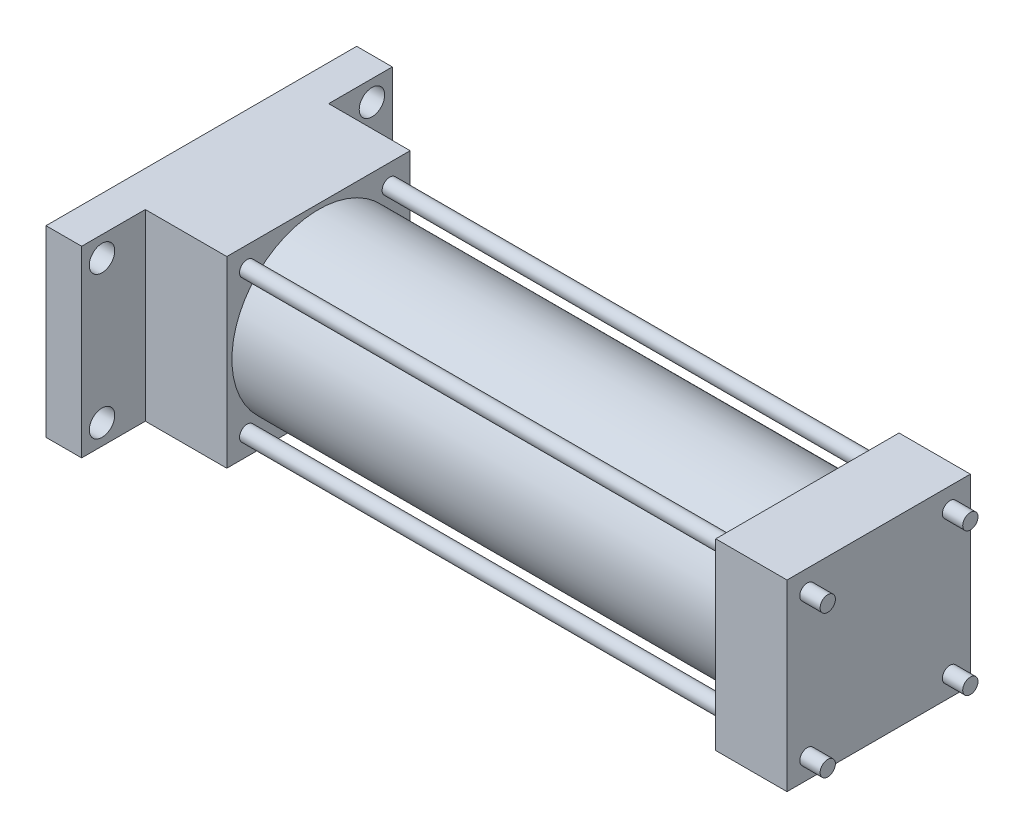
ISO-10303-21;
HEADER;
FILE_DESCRIPTION(('STEP AP214'),'2;1');
FILE_NAME('part.step','',(''),(''),'','','');
FILE_SCHEMA(('AUTOMOTIVE_DESIGN { 1 0 10303 214 1 1 1 1 }'));
ENDSEC;
DATA;
#1=APPLICATION_CONTEXT('core data for automotive mechanical design processes');
#2=APPLICATION_PROTOCOL_DEFINITION('international standard','automotive_design',2000,#1);
#3=PRODUCT_CONTEXT('',#1,'mechanical');
#4=PRODUCT('Part','Part','',(#3));
#5=PRODUCT_RELATED_PRODUCT_CATEGORY('part','',(#4));
#6=PRODUCT_DEFINITION_FORMATION('','',#4);
#7=PRODUCT_DEFINITION_CONTEXT('part definition',#1,'design');
#8=PRODUCT_DEFINITION('design','',#6,#7);
#9=PRODUCT_DEFINITION_SHAPE('','',#8);
#10=(LENGTH_UNIT() NAMED_UNIT(*) SI_UNIT(.MILLI.,.METRE.));
#11=(NAMED_UNIT(*) PLANE_ANGLE_UNIT() SI_UNIT($,.RADIAN.));
#12=(NAMED_UNIT(*) SI_UNIT($,.STERADIAN.) SOLID_ANGLE_UNIT());
#13=UNCERTAINTY_MEASURE_WITH_UNIT(LENGTH_MEASURE(1.E-05),#10,'distance_accuracy_value','');
#14=(GEOMETRIC_REPRESENTATION_CONTEXT(3) GLOBAL_UNCERTAINTY_ASSIGNED_CONTEXT((#13)) GLOBAL_UNIT_ASSIGNED_CONTEXT((#10,
#11,#12)) REPRESENTATION_CONTEXT('',''));
#15=CARTESIAN_POINT('',(0.,0.,0.));
#16=DIRECTION('',(0.,0.,1.));
#17=DIRECTION('',(1.,0.,0.));
#18=AXIS2_PLACEMENT_3D('',#15,#16,#17);
#19=CARTESIAN_POINT('',(-422.275,-57.15,57.1500000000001));
#20=DIRECTION('',(0.,0.,-1.));
#21=DIRECTION('',(0.,1.,0.));
#22=AXIS2_PLACEMENT_3D('',#19,#20,#21);
#23=PLANE('',#22);
#24=DIRECTION('',(0.,1.,0.));
#25=VECTOR('',#24,1.);
#26=CARTESIAN_POINT('',(-400.05,-57.15,57.1500000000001));
#27=LINE('',#26,#25);
#28=CARTESIAN_POINT('',(-400.05,-57.1499999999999,57.15));
#29=VERTEX_POINT('',#28);
#30=CARTESIAN_POINT('',(-400.05,57.15,57.15));
#31=VERTEX_POINT('',#30);
#32=EDGE_CURVE('E177',#29,#31,#27,.T.);
#33=ORIENTED_EDGE('',*,*,#32,.F.);
#34=DIRECTION('',(1.,0.,0.));
#35=VECTOR('',#34,1.);
#36=CARTESIAN_POINT('',(-422.275,-57.15,57.1500000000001));
#37=LINE('',#36,#35);
#38=CARTESIAN_POINT('',(-349.25,-57.15,57.1500000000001));
#39=VERTEX_POINT('',#38);
#40=EDGE_CURVE('E250',#29,#39,#37,.T.);
#41=ORIENTED_EDGE('',*,*,#40,.T.);
#42=DIRECTION('',(0.,1.,0.));
#43=VECTOR('',#42,1.);
#44=CARTESIAN_POINT('',(-349.25,-57.15,57.1500000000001));
#45=LINE('',#44,#43);
#46=CARTESIAN_POINT('',(-349.25,57.15,57.15));
#47=VERTEX_POINT('',#46);
#48=EDGE_CURVE('E235',#39,#47,#45,.T.);
#49=ORIENTED_EDGE('',*,*,#48,.T.);
#50=DIRECTION('',(1.,0.,0.));
#51=VECTOR('',#50,1.);
#52=CARTESIAN_POINT('',(-422.275,57.15,57.15));
#53=LINE('',#52,#51);
#54=EDGE_CURVE('E248',#31,#47,#53,.T.);
#55=ORIENTED_EDGE('',*,*,#54,.F.);
#56=EDGE_LOOP('',(#33,#41,#49,#55));
#57=FACE_BOUND('',#56,.T.);
#58=ADVANCED_FACE('F31',(#57),#23,.F.);
#59=CARTESIAN_POINT('',(-422.275,57.15,-57.15));
#60=DIRECTION('',(0.,0.,1.));
#61=DIRECTION('',(0.,-1.,0.));
#62=AXIS2_PLACEMENT_3D('',#59,#60,#61);
#63=PLANE('',#62);
#64=DIRECTION('',(0.,-1.,0.));
#65=VECTOR('',#64,1.);
#66=CARTESIAN_POINT('',(-400.05,57.15,-57.15));
#67=LINE('',#66,#65);
#68=CARTESIAN_POINT('',(-400.05,57.15,-57.15));
#69=VERTEX_POINT('',#68);
#70=CARTESIAN_POINT('',(-400.05,-57.1499999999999,-57.15));
#71=VERTEX_POINT('',#70);
#72=EDGE_CURVE('E175',#69,#71,#67,.T.);
#73=ORIENTED_EDGE('',*,*,#72,.F.);
#74=DIRECTION('',(1.,0.,0.));
#75=VECTOR('',#74,1.);
#76=CARTESIAN_POINT('',(-422.275,57.15,-57.15));
#77=LINE('',#76,#75);
#78=CARTESIAN_POINT('',(-349.25,57.15,-57.15));
#79=VERTEX_POINT('',#78);
#80=EDGE_CURVE('E246',#69,#79,#77,.T.);
#81=ORIENTED_EDGE('',*,*,#80,.T.);
#82=DIRECTION('',(0.,-1.,0.));
#83=VECTOR('',#82,1.);
#84=CARTESIAN_POINT('',(-349.25,57.15,-57.15));
#85=LINE('',#84,#83);
#86=CARTESIAN_POINT('',(-349.25,-57.15,-57.15));
#87=VERTEX_POINT('',#86);
#88=EDGE_CURVE('E241',#79,#87,#85,.T.);
#89=ORIENTED_EDGE('',*,*,#88,.T.);
#90=DIRECTION('',(1.,0.,0.));
#91=VECTOR('',#90,1.);
#92=CARTESIAN_POINT('',(-422.275,-57.15,-57.15));
#93=LINE('',#92,#91);
#94=EDGE_CURVE('E133',#71,#87,#93,.T.);
#95=ORIENTED_EDGE('',*,*,#94,.F.);
#96=EDGE_LOOP('',(#73,#81,#89,#95));
#97=FACE_BOUND('',#96,.T.);
#98=ADVANCED_FACE('F313',(#97),#63,.F.);
#99=CARTESIAN_POINT('',(-44.45,-57.15,57.1500000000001));
#100=DIRECTION('',(-1.,0.,0.));
#101=DIRECTION('',(0.,0.,1.));
#102=AXIS2_PLACEMENT_3D('',#99,#100,#101);
#103=PLANE('',#102);
#104=CARTESIAN_POINT('',(-44.45,-44.45,44.45));
#105=DIRECTION('',(-1.,0.,0.));
#106=DIRECTION('',(0.,0.,1.));
#107=AXIS2_PLACEMENT_3D('',#104,#105,#106);
#108=CIRCLE('',#107,4.7625);
#109=CARTESIAN_POINT('',(-44.45,-44.45,49.2125));
#110=VERTEX_POINT('',#109);
#111=EDGE_CURVE('E40',#110,#110,#108,.T.);
#112=ORIENTED_EDGE('',*,*,#111,.F.);
#113=EDGE_LOOP('',(#112));
#114=FACE_BOUND('',#113,.T.);
#115=CARTESIAN_POINT('',(-44.45,44.45,44.45));
#116=DIRECTION('',(-1.,0.,0.));
#117=DIRECTION('',(0.,0.,1.));
#118=AXIS2_PLACEMENT_3D('',#115,#116,#117);
#119=CIRCLE('',#118,4.7625);
#120=CARTESIAN_POINT('',(-44.45,44.45,49.2125));
#121=VERTEX_POINT('',#120);
#122=EDGE_CURVE('E216',#121,#121,#119,.F.);
#123=ORIENTED_EDGE('',*,*,#122,.T.);
#124=EDGE_LOOP('',(#123));
#125=FACE_BOUND('',#124,.T.);
#126=DIRECTION('',(0.,-1.,0.));
#127=VECTOR('',#126,1.);
#128=CARTESIAN_POINT('',(-44.45,57.15,57.15));
#129=LINE('',#128,#127);
#130=CARTESIAN_POINT('',(-44.45,57.15,57.15));
#131=VERTEX_POINT('',#130);
#132=CARTESIAN_POINT('',(-44.45,-57.15,57.1500000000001));
#133=VERTEX_POINT('',#132);
#134=EDGE_CURVE('E270',#131,#133,#129,.T.);
#135=ORIENTED_EDGE('',*,*,#134,.F.);
#136=DIRECTION('',(0.,0.,-1.));
#137=VECTOR('',#136,1.);
#138=CARTESIAN_POINT('',(-44.45,57.15,57.15));
#139=LINE('',#138,#137);
#140=CARTESIAN_POINT('',(-44.45,57.15,-57.15));
#141=VERTEX_POINT('',#140);
#142=EDGE_CURVE('E54',#131,#141,#139,.T.);
#143=ORIENTED_EDGE('',*,*,#142,.T.);
#144=DIRECTION('',(0.,1.,0.));
#145=VECTOR('',#144,1.);
#146=CARTESIAN_POINT('',(-44.45,-57.15,-57.15));
#147=LINE('',#146,#145);
#148=CARTESIAN_POINT('',(-44.45,-57.15,-57.15));
#149=VERTEX_POINT('',#148);
#150=EDGE_CURVE('E274',#149,#141,#147,.T.);
#151=ORIENTED_EDGE('',*,*,#150,.F.);
#152=DIRECTION('',(0.,0.,1.));
#153=VECTOR('',#152,1.);
#154=CARTESIAN_POINT('',(-44.45,-57.15,-57.15));
#155=LINE('',#154,#153);
#156=EDGE_CURVE('E272',#149,#133,#155,.T.);
#157=ORIENTED_EDGE('',*,*,#156,.T.);
#158=EDGE_LOOP('',(#135,#143,#151,#157));
#159=FACE_BOUND('',#158,.T.);
#160=CARTESIAN_POINT('',(-44.45,0.,0.));
#161=DIRECTION('',(-1.,0.,0.));
#162=DIRECTION('',(0.,0.,1.));
#163=AXIS2_PLACEMENT_3D('',#160,#161,#162);
#164=CIRCLE('',#163,53.975);
#165=CARTESIAN_POINT('',(-44.45,0.,-53.975));
#166=VERTEX_POINT('',#165);
#167=EDGE_CURVE('E252',#166,#166,#164,.T.);
#168=ORIENTED_EDGE('',*,*,#167,.F.);
#169=EDGE_LOOP('',(#168));
#170=FACE_BOUND('',#169,.T.);
#171=CARTESIAN_POINT('',(-44.45,44.45,-44.45));
#172=DIRECTION('',(-1.,0.,0.));
#173=DIRECTION('',(0.,0.,1.));
#174=AXIS2_PLACEMENT_3D('',#171,#172,#173);
#175=CIRCLE('',#174,4.7625);
#176=CARTESIAN_POINT('',(-44.45,44.45,-39.6875));
#177=VERTEX_POINT('',#176);
#178=EDGE_CURVE('E198',#177,#177,#175,.T.);
#179=ORIENTED_EDGE('',*,*,#178,.F.);
#180=EDGE_LOOP('',(#179));
#181=FACE_BOUND('',#180,.T.);
#182=CARTESIAN_POINT('',(-44.45,-44.45,-44.45));
#183=DIRECTION('',(-1.,0.,0.));
#184=DIRECTION('',(0.,0.,1.));
#185=AXIS2_PLACEMENT_3D('',#182,#183,#184);
#186=CIRCLE('',#185,4.7625);
#187=CARTESIAN_POINT('',(-44.45,-44.45,-39.6875));
#188=VERTEX_POINT('',#187);
#189=EDGE_CURVE('E194',#188,#188,#186,.F.);
#190=ORIENTED_EDGE('',*,*,#189,.T.);
#191=EDGE_LOOP('',(#190));
#192=FACE_BOUND('',#191,.T.);
#193=ADVANCED_FACE('F319',(#114,#125,#159,#170,#181,#192),#103,.T.);
#194=CARTESIAN_POINT('',(0.,-57.15,57.1500000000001));
#195=DIRECTION('',(-1.,0.,0.));
#196=DIRECTION('',(0.,0.,1.));
#197=AXIS2_PLACEMENT_3D('',#194,#195,#196);
#198=PLANE('',#197);
#199=CARTESIAN_POINT('',(0.,-44.45,44.45));
#200=DIRECTION('',(-1.,0.,0.));
#201=DIRECTION('',(0.,0.,1.));
#202=AXIS2_PLACEMENT_3D('',#199,#200,#201);
#203=CIRCLE('',#202,4.7625);
#204=CARTESIAN_POINT('',(0.,-44.45,49.2125));
#205=VERTEX_POINT('',#204);
#206=EDGE_CURVE('E182',#205,#205,#203,.T.);
#207=ORIENTED_EDGE('',*,*,#206,.T.);
#208=EDGE_LOOP('',(#207));
#209=FACE_BOUND('',#208,.T.);
#210=CARTESIAN_POINT('',(0.,44.45,44.45));
#211=DIRECTION('',(-1.,0.,0.));
#212=DIRECTION('',(0.,0.,1.));
#213=AXIS2_PLACEMENT_3D('',#210,#211,#212);
#214=CIRCLE('',#213,4.7625);
#215=CARTESIAN_POINT('',(0.,44.45,49.2125));
#216=VERTEX_POINT('',#215);
#217=EDGE_CURVE('E217',#216,#216,#214,.F.);
#218=ORIENTED_EDGE('',*,*,#217,.F.);
#219=EDGE_LOOP('',(#218));
#220=FACE_BOUND('',#219,.T.);
#221=DIRECTION('',(0.,-1.,0.));
#222=VECTOR('',#221,1.);
#223=CARTESIAN_POINT('',(0.,57.15,57.15));
#224=LINE('',#223,#222);
#225=CARTESIAN_POINT('',(0.,57.15,57.15));
#226=VERTEX_POINT('',#225);
#227=CARTESIAN_POINT('',(0.,-57.15,57.1500000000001));
#228=VERTEX_POINT('',#227);
#229=EDGE_CURVE('E258',#226,#228,#224,.T.);
#230=ORIENTED_EDGE('',*,*,#229,.T.);
#231=DIRECTION('',(0.,0.,1.));
#232=VECTOR('',#231,1.);
#233=CARTESIAN_POINT('',(0.,-57.15,-57.15));
#234=LINE('',#233,#232);
#235=CARTESIAN_POINT('',(0.,-57.15,-57.15));
#236=VERTEX_POINT('',#235);
#237=EDGE_CURVE('E261',#236,#228,#234,.T.);
#238=ORIENTED_EDGE('',*,*,#237,.F.);
#239=DIRECTION('',(0.,1.,0.));
#240=VECTOR('',#239,1.);
#241=CARTESIAN_POINT('',(0.,-57.15,-57.15));
#242=LINE('',#241,#240);
#243=CARTESIAN_POINT('',(0.,57.15,-57.15));
#244=VERTEX_POINT('',#243);
#245=EDGE_CURVE('E264',#236,#244,#242,.T.);
#246=ORIENTED_EDGE('',*,*,#245,.T.);
#247=DIRECTION('',(0.,0.,-1.));
#248=VECTOR('',#247,1.);
#249=CARTESIAN_POINT('',(0.,57.15,57.15));
#250=LINE('',#249,#248);
#251=EDGE_CURVE('E267',#226,#244,#250,.T.);
#252=ORIENTED_EDGE('',*,*,#251,.F.);
#253=EDGE_LOOP('',(#230,#238,#246,#252));
#254=FACE_BOUND('',#253,.T.);
#255=CARTESIAN_POINT('',(0.,44.45,-44.45));
#256=DIRECTION('',(-1.,0.,0.));
#257=DIRECTION('',(0.,0.,1.));
#258=AXIS2_PLACEMENT_3D('',#255,#256,#257);
#259=CIRCLE('',#258,4.7625);
#260=CARTESIAN_POINT('',(0.,44.45,-39.6875));
#261=VERTEX_POINT('',#260);
#262=EDGE_CURVE('E204',#261,#261,#259,.T.);
#263=ORIENTED_EDGE('',*,*,#262,.T.);
#264=EDGE_LOOP('',(#263));
#265=FACE_BOUND('',#264,.T.);
#266=CARTESIAN_POINT('',(0.,-44.45,-44.45));
#267=DIRECTION('',(-1.,0.,0.));
#268=DIRECTION('',(0.,0.,1.));
#269=AXIS2_PLACEMENT_3D('',#266,#267,#268);
#270=CIRCLE('',#269,4.7625);
#271=CARTESIAN_POINT('',(0.,-44.45,-39.6875));
#272=VERTEX_POINT('',#271);
#273=EDGE_CURVE('E195',#272,#272,#270,.F.);
#274=ORIENTED_EDGE('',*,*,#273,.F.);
#275=EDGE_LOOP('',(#274));
#276=FACE_BOUND('',#275,.T.);
#277=ADVANCED_FACE('F334',(#209,#220,#254,#265,#276),#198,.F.);
#278=CARTESIAN_POINT('',(-349.25,-57.15,-57.15));
#279=DIRECTION('',(1.,0.,0.));
#280=DIRECTION('',(0.,0.,-1.));
#281=AXIS2_PLACEMENT_3D('',#278,#279,#280);
#282=PLANE('',#281);
#283=CARTESIAN_POINT('',(-349.25,-44.45,44.45));
#284=DIRECTION('',(1.,0.,0.));
#285=DIRECTION('',(0.,0.,-1.));
#286=AXIS2_PLACEMENT_3D('',#283,#284,#285);
#287=CIRCLE('',#286,4.7625);
#288=CARTESIAN_POINT('',(-349.25,-44.45,39.6875));
#289=VERTEX_POINT('',#288);
#290=EDGE_CURVE('E188',#289,#289,#287,.T.);
#291=ORIENTED_EDGE('',*,*,#290,.F.);
#292=EDGE_LOOP('',(#291));
#293=FACE_BOUND('',#292,.T.);
#294=CARTESIAN_POINT('',(-349.25,44.45,44.45));
#295=DIRECTION('',(1.,0.,0.));
#296=DIRECTION('',(0.,0.,-1.));
#297=AXIS2_PLACEMENT_3D('',#294,#295,#296);
#298=CIRCLE('',#297,4.7625);
#299=CARTESIAN_POINT('',(-349.25,44.45,39.6875));
#300=VERTEX_POINT('',#299);
#301=EDGE_CURVE('E207',#300,#300,#298,.T.);
#302=ORIENTED_EDGE('',*,*,#301,.F.);
#303=EDGE_LOOP('',(#302));
#304=FACE_BOUND('',#303,.T.);
#305=DIRECTION('',(0.,0.,1.));
#306=VECTOR('',#305,1.);
#307=CARTESIAN_POINT('',(-349.25,-57.15,-57.15));
#308=LINE('',#307,#306);
#309=EDGE_CURVE('E232',#87,#39,#308,.T.);
#310=ORIENTED_EDGE('',*,*,#309,.F.);
#311=ORIENTED_EDGE('',*,*,#88,.F.);
#312=DIRECTION('',(0.,0.,-1.));
#313=VECTOR('',#312,1.);
#314=CARTESIAN_POINT('',(-349.25,57.15,57.15));
#315=LINE('',#314,#313);
#316=EDGE_CURVE('E238',#47,#79,#315,.T.);
#317=ORIENTED_EDGE('',*,*,#316,.F.);
#318=ORIENTED_EDGE('',*,*,#48,.F.);
#319=EDGE_LOOP('',(#310,#311,#317,#318));
#320=FACE_BOUND('',#319,.T.);
#321=CARTESIAN_POINT('',(-349.25,0.,0.));
#322=DIRECTION('',(-1.,0.,0.));
#323=DIRECTION('',(0.,0.,1.));
#324=AXIS2_PLACEMENT_3D('',#321,#322,#323);
#325=CIRCLE('',#324,53.975);
#326=CARTESIAN_POINT('',(-349.25,0.,-53.975));
#327=VERTEX_POINT('',#326);
#328=EDGE_CURVE('E255',#327,#327,#325,.T.);
#329=ORIENTED_EDGE('',*,*,#328,.T.);
#330=EDGE_LOOP('',(#329));
#331=FACE_BOUND('',#330,.T.);
#332=CARTESIAN_POINT('',(-349.25,44.45,-44.45));
#333=DIRECTION('',(1.,0.,0.));
#334=DIRECTION('',(0.,0.,-1.));
#335=AXIS2_PLACEMENT_3D('',#332,#333,#334);
#336=CIRCLE('',#335,4.7625);
#337=CARTESIAN_POINT('',(-349.25,44.45,-49.2125));
#338=VERTEX_POINT('',#337);
#339=EDGE_CURVE('E210',#338,#338,#336,.T.);
#340=ORIENTED_EDGE('',*,*,#339,.F.);
#341=EDGE_LOOP('',(#340));
#342=FACE_BOUND('',#341,.T.);
#343=CARTESIAN_POINT('',(-349.25,-44.45,-44.45));
#344=DIRECTION('',(1.,0.,0.));
#345=DIRECTION('',(0.,0.,-1.));
#346=AXIS2_PLACEMENT_3D('',#343,#344,#345);
#347=CIRCLE('',#346,4.7625);
#348=CARTESIAN_POINT('',(-349.25,-44.45,-49.2125));
#349=VERTEX_POINT('',#348);
#350=EDGE_CURVE('E185',#349,#349,#347,.T.);
#351=ORIENTED_EDGE('',*,*,#350,.F.);
#352=EDGE_LOOP('',(#351));
#353=FACE_BOUND('',#352,.T.);
#354=ADVANCED_FACE('F337',(#293,#304,#320,#331,#342,#353),#282,.T.);
#355=CARTESIAN_POINT('',(-422.275,-57.15,-57.15));
#356=DIRECTION('',(1.,0.,0.));
#357=DIRECTION('',(0.,0.,-1.));
#358=AXIS2_PLACEMENT_3D('',#355,#356,#357);
#359=PLANE('',#358);
#360=CARTESIAN_POINT('',(-422.275,44.45,-84.1375));
#361=DIRECTION('',(-1.,0.,0.));
#362=DIRECTION('',(0.,0.,1.));
#363=AXIS2_PLACEMENT_3D('',#360,#361,#362);
#364=CIRCLE('',#363,7.93749999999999);
#365=CARTESIAN_POINT('',(-422.275,44.45,-76.2));
#366=VERTEX_POINT('',#365);
#367=EDGE_CURVE('E647',#366,#366,#364,.T.);
#368=ORIENTED_EDGE('',*,*,#367,.F.);
#369=EDGE_LOOP('',(#368));
#370=FACE_BOUND('',#369,.T.);
#371=CARTESIAN_POINT('',(-422.275,-44.45,-84.1375));
#372=DIRECTION('',(-1.,0.,0.));
#373=DIRECTION('',(0.,0.,1.));
#374=AXIS2_PLACEMENT_3D('',#371,#372,#373);
#375=CIRCLE('',#374,7.93749999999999);
#376=CARTESIAN_POINT('',(-422.275,-44.45,-76.2));
#377=VERTEX_POINT('',#376);
#378=EDGE_CURVE('E651',#377,#377,#375,.T.);
#379=ORIENTED_EDGE('',*,*,#378,.F.);
#380=EDGE_LOOP('',(#379));
#381=FACE_BOUND('',#380,.T.);
#382=CARTESIAN_POINT('',(-422.275,44.45,84.1375));
#383=DIRECTION('',(-1.,0.,0.));
#384=DIRECTION('',(0.,0.,1.));
#385=AXIS2_PLACEMENT_3D('',#382,#383,#384);
#386=CIRCLE('',#385,7.93749999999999);
#387=CARTESIAN_POINT('',(-422.275,44.45,92.075));
#388=VERTEX_POINT('',#387);
#389=EDGE_CURVE('E660',#388,#388,#386,.T.);
#390=ORIENTED_EDGE('',*,*,#389,.F.);
#391=EDGE_LOOP('',(#390));
#392=FACE_BOUND('',#391,.T.);
#393=CARTESIAN_POINT('',(-422.275,-44.45,84.1375));
#394=DIRECTION('',(-1.,0.,0.));
#395=DIRECTION('',(0.,0.,1.));
#396=AXIS2_PLACEMENT_3D('',#393,#394,#395);
#397=CIRCLE('',#396,7.93749999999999);
#398=CARTESIAN_POINT('',(-422.275,-44.45,92.075));
#399=VERTEX_POINT('',#398);
#400=EDGE_CURVE('E155',#399,#399,#397,.T.);
#401=ORIENTED_EDGE('',*,*,#400,.F.);
#402=EDGE_LOOP('',(#401));
#403=FACE_BOUND('',#402,.T.);
#404=DIRECTION('',(0.,0.,1.));
#405=VECTOR('',#404,1.);
#406=CARTESIAN_POINT('',(-422.275,-57.15,-57.15));
#407=LINE('',#406,#405);
#408=CARTESIAN_POINT('',(-422.275,-57.1499999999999,-96.8375));
#409=VERTEX_POINT('',#408);
#410=CARTESIAN_POINT('',(-422.275,-57.1499999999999,96.8375));
#411=VERTEX_POINT('',#410);
#412=EDGE_CURVE('E134',#409,#411,#407,.T.);
#413=ORIENTED_EDGE('',*,*,#412,.T.);
#414=DIRECTION('',(0.,-1.,0.));
#415=VECTOR('',#414,1.);
#416=CARTESIAN_POINT('',(-422.275,57.15,96.8375));
#417=LINE('',#416,#415);
#418=CARTESIAN_POINT('',(-422.275,57.15,96.8375));
#419=VERTEX_POINT('',#418);
#420=EDGE_CURVE('E130',#419,#411,#417,.T.);
#421=ORIENTED_EDGE('',*,*,#420,.F.);
#422=DIRECTION('',(0.,0.,-1.));
#423=VECTOR('',#422,1.);
#424=CARTESIAN_POINT('',(-422.275,57.15,57.15));
#425=LINE('',#424,#423);
#426=CARTESIAN_POINT('',(-422.275,57.15,-96.8375));
#427=VERTEX_POINT('',#426);
#428=EDGE_CURVE('E123',#419,#427,#425,.T.);
#429=ORIENTED_EDGE('',*,*,#428,.T.);
#430=DIRECTION('',(0.,1.,0.));
#431=VECTOR('',#430,1.);
#432=CARTESIAN_POINT('',(-422.275,-57.1499999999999,-96.8375));
#433=LINE('',#432,#431);
#434=EDGE_CURVE('E128',#409,#427,#433,.T.);
#435=ORIENTED_EDGE('',*,*,#434,.F.);
#436=EDGE_LOOP('',(#413,#421,#429,#435));
#437=FACE_BOUND('',#436,.T.);
#438=CARTESIAN_POINT('',(-422.275,0.,0.));
#439=DIRECTION('',(1.,0.,0.));
#440=DIRECTION('',(0.,0.,-1.));
#441=AXIS2_PLACEMENT_3D('',#438,#439,#440);
#442=CIRCLE('',#441,25.4);
#443=CARTESIAN_POINT('',(-422.275,0.,-25.4));
#444=VERTEX_POINT('',#443);
#445=EDGE_CURVE('E220',#444,#444,#442,.F.);
#446=ORIENTED_EDGE('',*,*,#445,.F.);
#447=EDGE_LOOP('',(#446));
#448=FACE_BOUND('',#447,.T.);
#449=ADVANCED_FACE('F125',(#370,#381,#392,#403,#437,#448),#359,.F.);
#450=CARTESIAN_POINT('',(-44.45,57.15,57.15));
#451=DIRECTION('',(0.,0.,1.));
#452=DIRECTION('',(0.,-1.,0.));
#453=AXIS2_PLACEMENT_3D('',#450,#451,#452);
#454=PLANE('',#453);
#455=ORIENTED_EDGE('',*,*,#229,.F.);
#456=DIRECTION('',(1.,0.,0.));
#457=VECTOR('',#456,1.);
#458=CARTESIAN_POINT('',(-44.45,57.15,57.15));
#459=LINE('',#458,#457);
#460=EDGE_CURVE('E47',#131,#226,#459,.T.);
#461=ORIENTED_EDGE('',*,*,#460,.F.);
#462=ORIENTED_EDGE('',*,*,#134,.T.);
#463=DIRECTION('',(1.,0.,0.));
#464=VECTOR('',#463,1.);
#465=CARTESIAN_POINT('',(-44.45,-57.15,57.1500000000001));
#466=LINE('',#465,#464);
#467=EDGE_CURVE('E278',#133,#228,#466,.T.);
#468=ORIENTED_EDGE('',*,*,#467,.T.);
#469=EDGE_LOOP('',(#455,#461,#462,#468));
#470=FACE_BOUND('',#469,.T.);
#471=ADVANCED_FACE('F33',(#470),#454,.T.);
#472=CARTESIAN_POINT('',(-44.45,57.15,57.15));
#473=DIRECTION('',(0.,-1.,0.));
#474=DIRECTION('',(0.,0.,-1.));
#475=AXIS2_PLACEMENT_3D('',#472,#473,#474);
#476=PLANE('',#475);
#477=ORIENTED_EDGE('',*,*,#251,.T.);
#478=DIRECTION('',(1.,0.,0.));
#479=VECTOR('',#478,1.);
#480=CARTESIAN_POINT('',(-44.45,57.15,-57.15));
#481=LINE('',#480,#479);
#482=EDGE_CURVE('E280',#141,#244,#481,.T.);
#483=ORIENTED_EDGE('',*,*,#482,.F.);
#484=ORIENTED_EDGE('',*,*,#142,.F.);
#485=ORIENTED_EDGE('',*,*,#460,.T.);
#486=EDGE_LOOP('',(#477,#483,#484,#485));
#487=FACE_BOUND('',#486,.T.);
#488=ADVANCED_FACE('F342',(#487),#476,.F.);
#489=CARTESIAN_POINT('',(-44.45,-57.15,-57.15));
#490=DIRECTION('',(0.,0.,-1.));
#491=DIRECTION('',(0.,1.,0.));
#492=AXIS2_PLACEMENT_3D('',#489,#490,#491);
#493=PLANE('',#492);
#494=ORIENTED_EDGE('',*,*,#245,.F.);
#495=DIRECTION('',(1.,0.,0.));
#496=VECTOR('',#495,1.);
#497=CARTESIAN_POINT('',(-44.45,-57.15,-57.15));
#498=LINE('',#497,#496);
#499=EDGE_CURVE('E282',#149,#236,#498,.T.);
#500=ORIENTED_EDGE('',*,*,#499,.F.);
#501=ORIENTED_EDGE('',*,*,#150,.T.);
#502=ORIENTED_EDGE('',*,*,#482,.T.);
#503=EDGE_LOOP('',(#494,#500,#501,#502));
#504=FACE_BOUND('',#503,.T.);
#505=ADVANCED_FACE('F345',(#504),#493,.T.);
#506=CARTESIAN_POINT('',(-44.45,-57.15,-57.15));
#507=DIRECTION('',(0.,1.,0.));
#508=DIRECTION('',(0.,0.,1.));
#509=AXIS2_PLACEMENT_3D('',#506,#507,#508);
#510=PLANE('',#509);
#511=ORIENTED_EDGE('',*,*,#237,.T.);
#512=ORIENTED_EDGE('',*,*,#467,.F.);
#513=ORIENTED_EDGE('',*,*,#156,.F.);
#514=ORIENTED_EDGE('',*,*,#499,.T.);
#515=EDGE_LOOP('',(#511,#512,#513,#514));
#516=FACE_BOUND('',#515,.T.);
#517=ADVANCED_FACE('F332',(#516),#510,.F.);
#518=CARTESIAN_POINT('',(-349.25,0.,0.));
#519=DIRECTION('',(1.,0.,0.));
#520=DIRECTION('',(0.,0.,-1.));
#521=AXIS2_PLACEMENT_3D('',#518,#519,#520);
#522=CYLINDRICAL_SURFACE('',#521,53.975);
#523=CARTESIAN_POINT('',(-349.25,0.,-53.975));
#524=CARTESIAN_POINT('',(-346.075,0.,-53.975));
#525=CARTESIAN_POINT('',(-342.9,0.,-53.975));
#526=CARTESIAN_POINT('',(-336.55,0.,-53.975));
#527=CARTESIAN_POINT('',(-333.375,0.,-53.975));
#528=CARTESIAN_POINT('',(-327.025,0.,-53.975));
#529=CARTESIAN_POINT('',(-323.85,0.,-53.975));
#530=CARTESIAN_POINT('',(-317.5,0.,-53.975));
#531=CARTESIAN_POINT('',(-314.325,0.,-53.975));
#532=CARTESIAN_POINT('',(-307.975,0.,-53.975));
#533=CARTESIAN_POINT('',(-304.8,0.,-53.975));
#534=CARTESIAN_POINT('',(-298.45,0.,-53.975));
#535=CARTESIAN_POINT('',(-295.275,0.,-53.975));
#536=CARTESIAN_POINT('',(-288.925,0.,-53.975));
#537=CARTESIAN_POINT('',(-285.75,0.,-53.975));
#538=CARTESIAN_POINT('',(-279.4,0.,-53.975));
#539=CARTESIAN_POINT('',(-276.225,0.,-53.975));
#540=CARTESIAN_POINT('',(-269.875,0.,-53.975));
#541=CARTESIAN_POINT('',(-266.7,0.,-53.975));
#542=CARTESIAN_POINT('',(-260.35,0.,-53.975));
#543=CARTESIAN_POINT('',(-257.175,0.,-53.975));
#544=CARTESIAN_POINT('',(-250.825,0.,-53.975));
#545=CARTESIAN_POINT('',(-247.65,0.,-53.975));
#546=CARTESIAN_POINT('',(-241.3,0.,-53.975));
#547=CARTESIAN_POINT('',(-238.125,0.,-53.975));
#548=CARTESIAN_POINT('',(-231.775,0.,-53.975));
#549=CARTESIAN_POINT('',(-228.6,0.,-53.975));
#550=CARTESIAN_POINT('',(-222.25,0.,-53.975));
#551=CARTESIAN_POINT('',(-219.075,0.,-53.975));
#552=CARTESIAN_POINT('',(-212.725,0.,-53.975));
#553=CARTESIAN_POINT('',(-209.55,0.,-53.975));
#554=CARTESIAN_POINT('',(-203.2,0.,-53.975));
#555=CARTESIAN_POINT('',(-200.025,0.,-53.975));
#556=CARTESIAN_POINT('',(-193.675,0.,-53.975));
#557=CARTESIAN_POINT('',(-190.5,0.,-53.975));
#558=CARTESIAN_POINT('',(-184.15,0.,-53.975));
#559=CARTESIAN_POINT('',(-180.975,0.,-53.975));
#560=CARTESIAN_POINT('',(-174.625,0.,-53.975));
#561=CARTESIAN_POINT('',(-171.45,0.,-53.975));
#562=CARTESIAN_POINT('',(-165.1,0.,-53.975));
#563=CARTESIAN_POINT('',(-161.925,0.,-53.975));
#564=CARTESIAN_POINT('',(-155.575,0.,-53.975));
#565=CARTESIAN_POINT('',(-152.4,0.,-53.975));
#566=CARTESIAN_POINT('',(-146.05,0.,-53.975));
#567=CARTESIAN_POINT('',(-142.875,0.,-53.975));
#568=CARTESIAN_POINT('',(-136.525,0.,-53.975));
#569=CARTESIAN_POINT('',(-133.35,0.,-53.975));
#570=CARTESIAN_POINT('',(-127.,0.,-53.975));
#571=CARTESIAN_POINT('',(-123.825,0.,-53.975));
#572=CARTESIAN_POINT('',(-117.475,0.,-53.975));
#573=CARTESIAN_POINT('',(-114.3,0.,-53.975));
#574=CARTESIAN_POINT('',(-107.95,0.,-53.975));
#575=CARTESIAN_POINT('',(-104.775,0.,-53.975));
#576=CARTESIAN_POINT('',(-98.425,0.,-53.975));
#577=CARTESIAN_POINT('',(-95.25,0.,-53.975));
#578=CARTESIAN_POINT('',(-88.9,0.,-53.975));
#579=CARTESIAN_POINT('',(-85.725,0.,-53.975));
#580=CARTESIAN_POINT('',(-79.375,0.,-53.975));
#581=CARTESIAN_POINT('',(-76.2,0.,-53.975));
#582=CARTESIAN_POINT('',(-69.85,0.,-53.975));
#583=CARTESIAN_POINT('',(-66.675,0.,-53.975));
#584=CARTESIAN_POINT('',(-60.325,0.,-53.975));
#585=CARTESIAN_POINT('',(-57.15,0.,-53.975));
#586=CARTESIAN_POINT('',(-50.8,0.,-53.975));
#587=CARTESIAN_POINT('',(-47.625,0.,-53.975));
#588=CARTESIAN_POINT('',(-44.45,0.,-53.975));
#589=B_SPLINE_CURVE_WITH_KNOTS('',3,(#523,#524,#525,#526,#527,#528,#529,#530,#531,#532,#533,
#534,#535,#536,#537,#538,#539,#540,#541,#542,#543,#544,#545,#546,#547,#548,#549,#550,#551,#552,
#553,#554,#555,#556,#557,#558,#559,#560,#561,#562,#563,#564,#565,#566,#567,#568,#569,#570,#571,
#572,#573,#574,#575,#576,#577,#578,#579,#580,#581,#582,#583,#584,#585,#586,#587,#588),
.UNSPECIFIED.,.F.,.F.,(4,2,2,2,2,2,2,2,2,2,2,2,2,2,2,2,2,2,2,2,2,2,2,2,2,2,2,2,2,2,2,2,4),(0.,
9.52500000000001,19.05,28.575,38.1,47.625,57.15,66.675,76.2,85.7250000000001,95.2500000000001,
104.775,114.3,123.825,133.35,142.875,152.4,161.925,171.45,180.975,190.5,200.025,209.55,219.075,
228.6,238.125,247.65,257.175,266.7,276.225,285.75,295.275,304.8),.UNSPECIFIED.);
#590=EDGE_CURVE('BSEAM328',#327,#166,#589,.T.);
#591=ORIENTED_EDGE('',*,*,#328,.F.);
#592=ORIENTED_EDGE('',*,*,#167,.T.);
#593=ORIENTED_EDGE('',*,*,#590,.T.);
#594=ORIENTED_EDGE('',*,*,#590,.F.);
#595=EDGE_LOOP('',(#591,#593,#592,#594));
#596=FACE_BOUND('',#595,.T.);
#597=ADVANCED_FACE('F328',(#596),#522,.T.);
#598=CARTESIAN_POINT('',(-422.275,-57.15,-57.15));
#599=DIRECTION('',(0.,1.,0.));
#600=DIRECTION('',(0.,0.,1.));
#601=AXIS2_PLACEMENT_3D('',#598,#599,#600);
#602=PLANE('',#601);
#603=ORIENTED_EDGE('',*,*,#412,.F.);
#604=DIRECTION('',(-1.,0.,0.));
#605=VECTOR('',#604,1.);
#606=CARTESIAN_POINT('',(-400.05,-57.1499999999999,-96.8375));
#607=LINE('',#606,#605);
#608=CARTESIAN_POINT('',(-400.05,-57.1499999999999,-96.8375));
#609=VERTEX_POINT('',#608);
#610=EDGE_CURVE('E149',#609,#409,#607,.T.);
#611=ORIENTED_EDGE('',*,*,#610,.F.);
#612=DIRECTION('',(0.,0.,1.));
#613=VECTOR('',#612,1.);
#614=CARTESIAN_POINT('',(-400.05,-57.1499999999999,-96.8375));
#615=LINE('',#614,#613);
#616=EDGE_CURVE('E167',#609,#71,#615,.T.);
#617=ORIENTED_EDGE('',*,*,#616,.T.);
#618=ORIENTED_EDGE('',*,*,#94,.T.);
#619=ORIENTED_EDGE('',*,*,#309,.T.);
#620=ORIENTED_EDGE('',*,*,#40,.F.);
#621=CARTESIAN_POINT('',(-400.05,-57.1499999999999,96.8375));
#622=VERTEX_POINT('',#621);
#623=EDGE_CURVE('E166',#29,#622,#615,.T.);
#624=ORIENTED_EDGE('',*,*,#623,.T.);
#625=DIRECTION('',(-1.,0.,0.));
#626=VECTOR('',#625,1.);
#627=CARTESIAN_POINT('',(-400.05,-57.1499999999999,96.8375));
#628=LINE('',#627,#626);
#629=EDGE_CURVE('E171',#622,#411,#628,.T.);
#630=ORIENTED_EDGE('',*,*,#629,.T.);
#631=EDGE_LOOP('',(#603,#611,#617,#618,#619,#620,#624,#630));
#632=FACE_BOUND('',#631,.T.);
#633=ADVANCED_FACE('F325',(#632),#602,.F.);
#634=CARTESIAN_POINT('',(-422.275,57.15,57.15));
#635=DIRECTION('',(0.,-1.,0.));
#636=DIRECTION('',(0.,0.,-1.));
#637=AXIS2_PLACEMENT_3D('',#634,#635,#636);
#638=PLANE('',#637);
#639=ORIENTED_EDGE('',*,*,#428,.F.);
#640=DIRECTION('',(-1.,0.,0.));
#641=VECTOR('',#640,1.);
#642=CARTESIAN_POINT('',(-400.05,57.15,96.8375));
#643=LINE('',#642,#641);
#644=CARTESIAN_POINT('',(-400.05,57.15,96.8375));
#645=VERTEX_POINT('',#644);
#646=EDGE_CURVE('E145',#645,#419,#643,.T.);
#647=ORIENTED_EDGE('',*,*,#646,.F.);
#648=DIRECTION('',(0.,0.,-1.));
#649=VECTOR('',#648,1.);
#650=CARTESIAN_POINT('',(-400.05,57.15,96.8375));
#651=LINE('',#650,#649);
#652=EDGE_CURVE('E160',#645,#31,#651,.T.);
#653=ORIENTED_EDGE('',*,*,#652,.T.);
#654=ORIENTED_EDGE('',*,*,#54,.T.);
#655=ORIENTED_EDGE('',*,*,#316,.T.);
#656=ORIENTED_EDGE('',*,*,#80,.F.);
#657=CARTESIAN_POINT('',(-400.05,57.15,-96.8375));
#658=VERTEX_POINT('',#657);
#659=EDGE_CURVE('E140',#69,#658,#651,.T.);
#660=ORIENTED_EDGE('',*,*,#659,.T.);
#661=DIRECTION('',(-1.,0.,0.));
#662=VECTOR('',#661,1.);
#663=CARTESIAN_POINT('',(-400.05,57.15,-96.8375));
#664=LINE('',#663,#662);
#665=EDGE_CURVE('E137',#658,#427,#664,.T.);
#666=ORIENTED_EDGE('',*,*,#665,.T.);
#667=EDGE_LOOP('',(#639,#647,#653,#654,#655,#656,#660,#666));
#668=FACE_BOUND('',#667,.T.);
#669=ADVANCED_FACE('F138',(#668),#638,.F.);
#670=CARTESIAN_POINT('',(-447.675,0.,0.));
#671=DIRECTION('',(1.,0.,0.));
#672=DIRECTION('',(0.,0.,-1.));
#673=AXIS2_PLACEMENT_3D('',#670,#671,#672);
#674=CYLINDRICAL_SURFACE('',#673,25.4);
#675=CARTESIAN_POINT('',(-447.675,0.,0.));
#676=DIRECTION('',(-1.,0.,0.));
#677=DIRECTION('',(0.,0.,1.));
#678=AXIS2_PLACEMENT_3D('',#675,#676,#677);
#679=CIRCLE('',#678,25.4);
#680=CARTESIAN_POINT('',(-447.675,0.,25.4));
#681=VERTEX_POINT('',#680);
#682=EDGE_CURVE('E229',#681,#681,#679,.T.);
#683=ORIENTED_EDGE('',*,*,#682,.F.);
#684=EDGE_LOOP('',(#683));
#685=FACE_BOUND('',#684,.T.);
#686=ORIENTED_EDGE('',*,*,#445,.T.);
#687=EDGE_LOOP('',(#686));
#688=FACE_BOUND('',#687,.T.);
#689=ADVANCED_FACE('F387',(#685,#688),#674,.T.);
#690=CARTESIAN_POINT('',(-447.675,0.,0.));
#691=DIRECTION('',(-1.,0.,0.));
#692=DIRECTION('',(0.,0.,1.));
#693=AXIS2_PLACEMENT_3D('',#690,#691,#692);
#694=PLANE('',#693);
#695=CARTESIAN_POINT('',(-447.675,0.,0.));
#696=DIRECTION('',(-1.,0.,0.));
#697=DIRECTION('',(0.,0.,1.));
#698=AXIS2_PLACEMENT_3D('',#695,#696,#697);
#699=CIRCLE('',#698,17.4625);
#700=CARTESIAN_POINT('',(-447.675,0.,17.4625));
#701=VERTEX_POINT('',#700);
#702=EDGE_CURVE('E223',#701,#701,#699,.T.);
#703=ORIENTED_EDGE('',*,*,#702,.F.);
#704=EDGE_LOOP('',(#703));
#705=FACE_BOUND('',#704,.T.);
#706=ORIENTED_EDGE('',*,*,#682,.T.);
#707=EDGE_LOOP('',(#706));
#708=FACE_BOUND('',#707,.T.);
#709=ADVANCED_FACE('F390',(#705,#708),#694,.T.);
#710=CARTESIAN_POINT('',(4.94140866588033,0.,0.));
#711=DIRECTION('',(-1.,0.,0.));
#712=DIRECTION('',(0.,0.,1.));
#713=AXIS2_PLACEMENT_3D('',#710,#711,#712);
#714=CYLINDRICAL_SURFACE('',#713,17.4625);
#715=CARTESIAN_POINT('',(-422.275,0.,0.));
#716=DIRECTION('',(-1.,0.,0.));
#717=DIRECTION('',(0.,0.,1.));
#718=AXIS2_PLACEMENT_3D('',#715,#716,#717);
#719=CIRCLE('',#718,17.4625);
#720=CARTESIAN_POINT('',(-422.275,0.,17.4625));
#721=VERTEX_POINT('',#720);
#722=EDGE_CURVE('E144',#721,#721,#719,.F.);
#723=ORIENTED_EDGE('',*,*,#722,.T.);
#724=EDGE_LOOP('',(#723));
#725=FACE_BOUND('',#724,.T.);
#726=ORIENTED_EDGE('',*,*,#702,.T.);
#727=EDGE_LOOP('',(#726));
#728=FACE_BOUND('',#727,.T.);
#729=ADVANCED_FACE('F293',(#725,#728),#714,.F.);
#730=CARTESIAN_POINT('',(26.1703841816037,44.45,44.45));
#731=DIRECTION('',(-1.,0.,0.));
#732=DIRECTION('',(0.,0.,1.));
#733=AXIS2_PLACEMENT_3D('',#730,#731,#732);
#734=CYLINDRICAL_SURFACE('',#733,4.7625);
#735=ORIENTED_EDGE('',*,*,#122,.F.);
#736=EDGE_LOOP('',(#735));
#737=FACE_BOUND('',#736,.T.);
#738=ORIENTED_EDGE('',*,*,#301,.T.);
#739=EDGE_LOOP('',(#738));
#740=FACE_BOUND('',#739,.T.);
#741=ADVANCED_FACE('F396',(#737,#740),#734,.T.);
#742=CARTESIAN_POINT('',(12.7,44.45,44.45));
#743=DIRECTION('',(1.,0.,0.));
#744=DIRECTION('',(0.,0.,-1.));
#745=AXIS2_PLACEMENT_3D('',#742,#743,#744);
#746=CIRCLE('',#745,4.7625);
#747=CARTESIAN_POINT('',(12.7,44.45,39.6875));
#748=VERTEX_POINT('',#747);
#749=EDGE_CURVE('E213',#748,#748,#746,.T.);
#750=ORIENTED_EDGE('',*,*,#749,.F.);
#751=EDGE_LOOP('',(#750));
#752=FACE_BOUND('',#751,.T.);
#753=ORIENTED_EDGE('',*,*,#217,.T.);
#754=EDGE_LOOP('',(#753));
#755=FACE_BOUND('',#754,.T.);
#756=ADVANCED_FACE('F408',(#752,#755),#734,.T.);
#757=CARTESIAN_POINT('',(12.7,-57.15,57.1500000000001));
#758=DIRECTION('',(1.,0.,0.));
#759=DIRECTION('',(0.,0.,-1.));
#760=AXIS2_PLACEMENT_3D('',#757,#758,#759);
#761=PLANE('',#760);
#762=ORIENTED_EDGE('',*,*,#749,.T.);
#763=EDGE_LOOP('',(#762));
#764=FACE_BOUND('',#763,.T.);
#765=ADVANCED_FACE('F404',(#764),#761,.T.);
#766=CARTESIAN_POINT('',(26.1703841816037,44.45,-44.45));
#767=DIRECTION('',(-1.,0.,0.));
#768=DIRECTION('',(0.,0.,1.));
#769=AXIS2_PLACEMENT_3D('',#766,#767,#768);
#770=CYLINDRICAL_SURFACE('',#769,4.7625);
#771=ORIENTED_EDGE('',*,*,#178,.T.);
#772=EDGE_LOOP('',(#771));
#773=FACE_BOUND('',#772,.T.);
#774=ORIENTED_EDGE('',*,*,#339,.T.);
#775=EDGE_LOOP('',(#774));
#776=FACE_BOUND('',#775,.T.);
#777=ADVANCED_FACE('F407',(#773,#776),#770,.T.);
#778=CARTESIAN_POINT('',(12.7,44.45,-44.45));
#779=DIRECTION('',(1.,0.,0.));
#780=DIRECTION('',(0.,0.,-1.));
#781=AXIS2_PLACEMENT_3D('',#778,#779,#780);
#782=CIRCLE('',#781,4.7625);
#783=CARTESIAN_POINT('',(12.7,44.45,-49.2125));
#784=VERTEX_POINT('',#783);
#785=EDGE_CURVE('E201',#784,#784,#782,.F.);
#786=ORIENTED_EDGE('',*,*,#785,.T.);
#787=EDGE_LOOP('',(#786));
#788=FACE_BOUND('',#787,.T.);
#789=ORIENTED_EDGE('',*,*,#262,.F.);
#790=EDGE_LOOP('',(#789));
#791=FACE_BOUND('',#790,.T.);
#792=ADVANCED_FACE('F414',(#788,#791),#770,.T.);
#793=CARTESIAN_POINT('',(12.7,-57.15,57.1500000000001));
#794=DIRECTION('',(1.,0.,0.));
#795=DIRECTION('',(0.,0.,-1.));
#796=AXIS2_PLACEMENT_3D('',#793,#794,#795);
#797=PLANE('',#796);
#798=ORIENTED_EDGE('',*,*,#785,.F.);
#799=EDGE_LOOP('',(#798));
#800=FACE_BOUND('',#799,.T.);
#801=ADVANCED_FACE('F371',(#800),#797,.T.);
#802=CARTESIAN_POINT('',(26.1703841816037,-44.45,-44.45));
#803=DIRECTION('',(-1.,0.,0.));
#804=DIRECTION('',(0.,0.,1.));
#805=AXIS2_PLACEMENT_3D('',#802,#803,#804);
#806=CYLINDRICAL_SURFACE('',#805,4.7625);
#807=ORIENTED_EDGE('',*,*,#189,.F.);
#808=EDGE_LOOP('',(#807));
#809=FACE_BOUND('',#808,.T.);
#810=ORIENTED_EDGE('',*,*,#350,.T.);
#811=EDGE_LOOP('',(#810));
#812=FACE_BOUND('',#811,.T.);
#813=ADVANCED_FACE('F367',(#809,#812),#806,.T.);
#814=CARTESIAN_POINT('',(12.7,-44.45,-44.45));
#815=DIRECTION('',(1.,0.,0.));
#816=DIRECTION('',(0.,0.,-1.));
#817=AXIS2_PLACEMENT_3D('',#814,#815,#816);
#818=CIRCLE('',#817,4.7625);
#819=CARTESIAN_POINT('',(12.7,-44.45,-49.2125));
#820=VERTEX_POINT('',#819);
#821=EDGE_CURVE('E191',#820,#820,#818,.T.);
#822=ORIENTED_EDGE('',*,*,#821,.F.);
#823=EDGE_LOOP('',(#822));
#824=FACE_BOUND('',#823,.T.);
#825=ORIENTED_EDGE('',*,*,#273,.T.);
#826=EDGE_LOOP('',(#825));
#827=FACE_BOUND('',#826,.T.);
#828=ADVANCED_FACE('F370',(#824,#827),#806,.T.);
#829=CARTESIAN_POINT('',(12.7,-57.15,57.1500000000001));
#830=DIRECTION('',(1.,0.,0.));
#831=DIRECTION('',(0.,0.,-1.));
#832=AXIS2_PLACEMENT_3D('',#829,#830,#831);
#833=PLANE('',#832);
#834=ORIENTED_EDGE('',*,*,#821,.T.);
#835=EDGE_LOOP('',(#834));
#836=FACE_BOUND('',#835,.T.);
#837=ADVANCED_FACE('F419',(#836),#833,.T.);
#838=CARTESIAN_POINT('',(26.1703841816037,-44.45,44.45));
#839=DIRECTION('',(-1.,0.,0.));
#840=DIRECTION('',(0.,0.,1.));
#841=AXIS2_PLACEMENT_3D('',#838,#839,#840);
#842=CYLINDRICAL_SURFACE('',#841,4.7625);
#843=ORIENTED_EDGE('',*,*,#111,.T.);
#844=EDGE_LOOP('',(#843));
#845=FACE_BOUND('',#844,.T.);
#846=ORIENTED_EDGE('',*,*,#290,.T.);
#847=EDGE_LOOP('',(#846));
#848=FACE_BOUND('',#847,.T.);
#849=ADVANCED_FACE('F421',(#845,#848),#842,.T.);
#850=CARTESIAN_POINT('',(12.7,-44.45,44.45));
#851=DIRECTION('',(1.,0.,0.));
#852=DIRECTION('',(0.,0.,-1.));
#853=AXIS2_PLACEMENT_3D('',#850,#851,#852);
#854=CIRCLE('',#853,4.7625);
#855=CARTESIAN_POINT('',(12.7,-44.45,39.6875));
#856=VERTEX_POINT('',#855);
#857=EDGE_CURVE('E179',#856,#856,#854,.F.);
#858=ORIENTED_EDGE('',*,*,#857,.T.);
#859=EDGE_LOOP('',(#858));
#860=FACE_BOUND('',#859,.T.);
#861=ORIENTED_EDGE('',*,*,#206,.F.);
#862=EDGE_LOOP('',(#861));
#863=FACE_BOUND('',#862,.T.);
#864=ADVANCED_FACE('F307',(#860,#863),#842,.T.);
#865=CARTESIAN_POINT('',(12.7,-57.15,57.1500000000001));
#866=DIRECTION('',(1.,0.,0.));
#867=DIRECTION('',(0.,0.,-1.));
#868=AXIS2_PLACEMENT_3D('',#865,#866,#867);
#869=PLANE('',#868);
#870=ORIENTED_EDGE('',*,*,#857,.F.);
#871=EDGE_LOOP('',(#870));
#872=FACE_BOUND('',#871,.T.);
#873=ADVANCED_FACE('F298',(#872),#869,.T.);
#874=CARTESIAN_POINT('',(-422.275,57.15,-96.8375));
#875=DIRECTION('',(-1.,0.,0.));
#876=DIRECTION('',(0.,0.,1.));
#877=AXIS2_PLACEMENT_3D('',#874,#875,#876);
#878=PLANE('',#877);
#879=ORIENTED_EDGE('',*,*,#722,.F.);
#880=EDGE_LOOP('',(#879));
#881=FACE_BOUND('',#880,.T.);
#882=ADVANCED_FACE('F296',(#881),#878,.T.);
#883=CARTESIAN_POINT('',(-400.05,-57.1499999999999,-96.8375));
#884=DIRECTION('',(0.,0.,1.));
#885=DIRECTION('',(1.,0.,0.));
#886=AXIS2_PLACEMENT_3D('',#883,#884,#885);
#887=PLANE('',#886);
#888=ORIENTED_EDGE('',*,*,#434,.T.);
#889=ORIENTED_EDGE('',*,*,#665,.F.);
#890=DIRECTION('',(0.,1.,0.));
#891=VECTOR('',#890,1.);
#892=CARTESIAN_POINT('',(-400.05,-57.1499999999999,-96.8375));
#893=LINE('',#892,#891);
#894=EDGE_CURVE('E152',#609,#658,#893,.T.);
#895=ORIENTED_EDGE('',*,*,#894,.F.);
#896=ORIENTED_EDGE('',*,*,#610,.T.);
#897=EDGE_LOOP('',(#888,#889,#895,#896));
#898=FACE_BOUND('',#897,.T.);
#899=ADVANCED_FACE('F148',(#898),#887,.F.);
#900=CARTESIAN_POINT('',(-400.05,57.15,-96.8375));
#901=DIRECTION('',(-1.,0.,0.));
#902=DIRECTION('',(0.,0.,1.));
#903=AXIS2_PLACEMENT_3D('',#900,#901,#902);
#904=PLANE('',#903);
#905=CARTESIAN_POINT('',(-400.05,44.45,-84.1375));
#906=DIRECTION('',(-1.,0.,0.));
#907=DIRECTION('',(0.,0.,1.));
#908=AXIS2_PLACEMENT_3D('',#905,#906,#907);
#909=CIRCLE('',#908,7.93749999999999);
#910=CARTESIAN_POINT('',(-400.05,44.45,-76.2));
#911=VERTEX_POINT('',#910);
#912=EDGE_CURVE('E650',#911,#911,#909,.F.);
#913=ORIENTED_EDGE('',*,*,#912,.F.);
#914=EDGE_LOOP('',(#913));
#915=FACE_BOUND('',#914,.T.);
#916=CARTESIAN_POINT('',(-400.05,-44.45,-84.1375));
#917=DIRECTION('',(-1.,0.,0.));
#918=DIRECTION('',(0.,0.,1.));
#919=AXIS2_PLACEMENT_3D('',#916,#917,#918);
#920=CIRCLE('',#919,7.93749999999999);
#921=CARTESIAN_POINT('',(-400.05,-44.45,-76.2));
#922=VERTEX_POINT('',#921);
#923=EDGE_CURVE('E654',#922,#922,#920,.F.);
#924=ORIENTED_EDGE('',*,*,#923,.F.);
#925=EDGE_LOOP('',(#924));
#926=FACE_BOUND('',#925,.T.);
#927=ORIENTED_EDGE('',*,*,#659,.F.);
#928=ORIENTED_EDGE('',*,*,#72,.T.);
#929=ORIENTED_EDGE('',*,*,#616,.F.);
#930=ORIENTED_EDGE('',*,*,#894,.T.);
#931=EDGE_LOOP('',(#927,#928,#929,#930));
#932=FACE_BOUND('',#931,.T.);
#933=ADVANCED_FACE('F304',(#915,#926,#932),#904,.F.);
#934=CARTESIAN_POINT('',(-400.05,44.45,84.1375));
#935=DIRECTION('',(-1.,0.,0.));
#936=DIRECTION('',(0.,0.,1.));
#937=AXIS2_PLACEMENT_3D('',#934,#935,#936);
#938=CIRCLE('',#937,7.93749999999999);
#939=CARTESIAN_POINT('',(-400.05,44.45,92.075));
#940=VERTEX_POINT('',#939);
#941=EDGE_CURVE('E663',#940,#940,#938,.F.);
#942=ORIENTED_EDGE('',*,*,#941,.F.);
#943=EDGE_LOOP('',(#942));
#944=FACE_BOUND('',#943,.T.);
#945=CARTESIAN_POINT('',(-400.05,-44.45,84.1375));
#946=DIRECTION('',(-1.,0.,0.));
#947=DIRECTION('',(0.,0.,1.));
#948=AXIS2_PLACEMENT_3D('',#945,#946,#947);
#949=CIRCLE('',#948,7.93749999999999);
#950=CARTESIAN_POINT('',(-400.05,-44.45,92.075));
#951=VERTEX_POINT('',#950);
#952=EDGE_CURVE('E150',#951,#951,#949,.F.);
#953=ORIENTED_EDGE('',*,*,#952,.F.);
#954=EDGE_LOOP('',(#953));
#955=FACE_BOUND('',#954,.T.);
#956=ORIENTED_EDGE('',*,*,#623,.F.);
#957=ORIENTED_EDGE('',*,*,#32,.T.);
#958=ORIENTED_EDGE('',*,*,#652,.F.);
#959=DIRECTION('',(0.,-1.,0.));
#960=VECTOR('',#959,1.);
#961=CARTESIAN_POINT('',(-400.05,57.15,96.8375));
#962=LINE('',#961,#960);
#963=EDGE_CURVE('E163',#645,#622,#962,.T.);
#964=ORIENTED_EDGE('',*,*,#963,.T.);
#965=EDGE_LOOP('',(#956,#957,#958,#964));
#966=FACE_BOUND('',#965,.T.);
#967=ADVANCED_FACE('F430',(#944,#955,#966),#904,.F.);
#968=CARTESIAN_POINT('',(-400.05,57.15,96.8375));
#969=DIRECTION('',(0.,0.,-1.));
#970=DIRECTION('',(-1.,0.,0.));
#971=AXIS2_PLACEMENT_3D('',#968,#969,#970);
#972=PLANE('',#971);
#973=ORIENTED_EDGE('',*,*,#420,.T.);
#974=ORIENTED_EDGE('',*,*,#629,.F.);
#975=ORIENTED_EDGE('',*,*,#963,.F.);
#976=ORIENTED_EDGE('',*,*,#646,.T.);
#977=EDGE_LOOP('',(#973,#974,#975,#976));
#978=FACE_BOUND('',#977,.T.);
#979=ADVANCED_FACE('F427',(#978),#972,.F.);
#980=CARTESIAN_POINT('',(12.701,-44.45,84.1375));
#981=DIRECTION('',(-1.,0.,0.));
#982=DIRECTION('',(0.,0.,1.));
#983=AXIS2_PLACEMENT_3D('',#980,#981,#982);
#984=CYLINDRICAL_SURFACE('',#983,7.93749999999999);
#985=ORIENTED_EDGE('',*,*,#400,.T.);
#986=EDGE_LOOP('',(#985));
#987=FACE_BOUND('',#986,.T.);
#988=ORIENTED_EDGE('',*,*,#952,.T.);
#989=EDGE_LOOP('',(#988));
#990=FACE_BOUND('',#989,.T.);
#991=ADVANCED_FACE('F429',(#987,#990),#984,.F.);
#992=CARTESIAN_POINT('',(12.701,44.45,84.1375));
#993=DIRECTION('',(-1.,0.,0.));
#994=DIRECTION('',(0.,0.,1.));
#995=AXIS2_PLACEMENT_3D('',#992,#993,#994);
#996=CYLINDRICAL_SURFACE('',#995,7.93749999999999);
#997=ORIENTED_EDGE('',*,*,#389,.T.);
#998=EDGE_LOOP('',(#997));
#999=FACE_BOUND('',#998,.T.);
#1000=ORIENTED_EDGE('',*,*,#941,.T.);
#1001=EDGE_LOOP('',(#1000));
#1002=FACE_BOUND('',#1001,.T.);
#1003=ADVANCED_FACE('F459',(#999,#1002),#996,.F.);
#1004=CARTESIAN_POINT('',(12.701,-44.45,-84.1375));
#1005=DIRECTION('',(-1.,0.,0.));
#1006=DIRECTION('',(0.,0.,1.));
#1007=AXIS2_PLACEMENT_3D('',#1004,#1005,#1006);
#1008=CYLINDRICAL_SURFACE('',#1007,7.93749999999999);
#1009=ORIENTED_EDGE('',*,*,#378,.T.);
#1010=EDGE_LOOP('',(#1009));
#1011=FACE_BOUND('',#1010,.T.);
#1012=ORIENTED_EDGE('',*,*,#923,.T.);
#1013=EDGE_LOOP('',(#1012));
#1014=FACE_BOUND('',#1013,.T.);
#1015=ADVANCED_FACE('F626',(#1011,#1014),#1008,.F.);
#1016=CARTESIAN_POINT('',(12.701,44.45,-84.1375));
#1017=DIRECTION('',(-1.,0.,0.));
#1018=DIRECTION('',(0.,0.,1.));
#1019=AXIS2_PLACEMENT_3D('',#1016,#1017,#1018);
#1020=CYLINDRICAL_SURFACE('',#1019,7.93749999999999);
#1021=ORIENTED_EDGE('',*,*,#367,.T.);
#1022=EDGE_LOOP('',(#1021));
#1023=FACE_BOUND('',#1022,.T.);
#1024=ORIENTED_EDGE('',*,*,#912,.T.);
#1025=EDGE_LOOP('',(#1024));
#1026=FACE_BOUND('',#1025,.T.);
#1027=ADVANCED_FACE('F634',(#1023,#1026),#1020,.F.);
#1028=CLOSED_SHELL('',(#58,#98,#193,#277,#354,#449,#471,#488,#505,#517,#597,#633,#669,#689,#709,
#729,#741,#756,#765,#777,#792,#801,#813,#828,#837,#849,#864,#873,#882,#899,#933,#967,#979,#991,
#1003,#1015,#1027));
#1029=CARTESIAN_POINT('',(-400.05,0.,0.));
#1030=DIRECTION('',(-1.,0.,0.));
#1031=DIRECTION('',(0.,0.,1.));
#1032=AXIS2_PLACEMENT_3D('',#1029,#1030,#1031);
#1033=CIRCLE('',#1032,17.4625);
#1034=CARTESIAN_POINT('',(-400.05,0.,17.4625));
#1035=VERTEX_POINT('',#1034);
#1036=EDGE_CURVE('E11',#1035,#1035,#1033,.F.);
#1037=ORIENTED_EDGE('',*,*,#1036,.T.);
#1038=EDGE_LOOP('',(#1037));
#1039=FACE_BOUND('',#1038,.T.);
#1040=ADVANCED_FACE('F401',(#1039),#904,.F.);
#1041=CARTESIAN_POINT('',(-44.45,-57.15,57.1500000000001));
#1042=DIRECTION('',(-1.,0.,0.));
#1043=DIRECTION('',(0.,0.,1.));
#1044=AXIS2_PLACEMENT_3D('',#1041,#1042,#1043);
#1045=PLANE('',#1044);
#1046=CARTESIAN_POINT('',(-44.45,0.,0.));
#1047=DIRECTION('',(-1.,0.,0.));
#1048=DIRECTION('',(0.,0.,1.));
#1049=AXIS2_PLACEMENT_3D('',#1046,#1047,#1048);
#1050=CIRCLE('',#1049,17.4625);
#1051=CARTESIAN_POINT('',(-44.45,0.,17.4625));
#1052=VERTEX_POINT('',#1051);
#1053=EDGE_CURVE('E226',#1052,#1052,#1050,.F.);
#1054=ORIENTED_EDGE('',*,*,#1053,.F.);
#1055=EDGE_LOOP('',(#1054));
#1056=FACE_BOUND('',#1055,.T.);
#1057=ADVANCED_FACE('F398',(#1056),#1045,.T.);
#1058=ORIENTED_EDGE('',*,*,#1053,.T.);
#1059=EDGE_LOOP('',(#1058));
#1060=FACE_BOUND('',#1059,.T.);
#1061=ORIENTED_EDGE('',*,*,#1036,.F.);
#1062=EDGE_LOOP('',(#1061));
#1063=FACE_BOUND('',#1062,.T.);
#1064=ADVANCED_FACE('F397',(#1060,#1063),#714,.F.);
#1065=CLOSED_SHELL('',(#1040,#1057,#1064));
#1066=ORIENTED_CLOSED_SHELL('',*,#1065,.T.);
#1067=BREP_WITH_VOIDS('B2',#1028,(#1066));
#1068=ADVANCED_BREP_SHAPE_REPRESENTATION('',(#18,#1067),#14);
#1069=SHAPE_DEFINITION_REPRESENTATION(#9,#1068);
ENDSEC;
END-ISO-10303-21;
